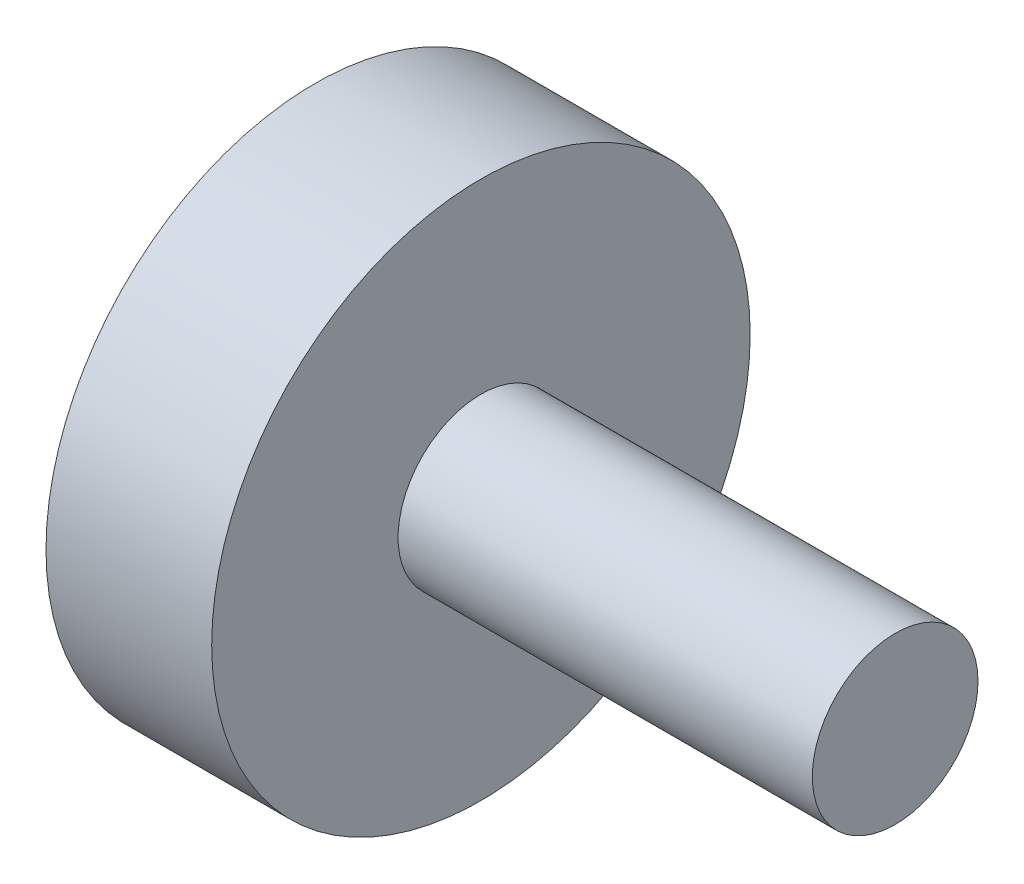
ISO-10303-21;
HEADER;
FILE_DESCRIPTION(('STEP AP214'),'2;1');
FILE_NAME('part.step','',(''),(''),'','','');
FILE_SCHEMA(('AUTOMOTIVE_DESIGN { 1 0 10303 214 1 1 1 1 }'));
ENDSEC;
DATA;
#1=APPLICATION_CONTEXT('core data for automotive mechanical design processes');
#2=APPLICATION_PROTOCOL_DEFINITION('international standard','automotive_design',2000,#1);
#3=PRODUCT_CONTEXT('',#1,'mechanical');
#4=PRODUCT('Part','Part','',(#3));
#5=PRODUCT_RELATED_PRODUCT_CATEGORY('part','',(#4));
#6=PRODUCT_DEFINITION_FORMATION('','',#4);
#7=PRODUCT_DEFINITION_CONTEXT('part definition',#1,'design');
#8=PRODUCT_DEFINITION('design','',#6,#7);
#9=PRODUCT_DEFINITION_SHAPE('','',#8);
#10=(LENGTH_UNIT() NAMED_UNIT(*) SI_UNIT(.MILLI.,.METRE.));
#11=(NAMED_UNIT(*) PLANE_ANGLE_UNIT() SI_UNIT($,.RADIAN.));
#12=(NAMED_UNIT(*) SI_UNIT($,.STERADIAN.) SOLID_ANGLE_UNIT());
#13=UNCERTAINTY_MEASURE_WITH_UNIT(LENGTH_MEASURE(1.E-05),#10,'distance_accuracy_value','');
#14=(GEOMETRIC_REPRESENTATION_CONTEXT(3) GLOBAL_UNCERTAINTY_ASSIGNED_CONTEXT((#13)) GLOBAL_UNIT_ASSIGNED_CONTEXT((#10,
#11,#12)) REPRESENTATION_CONTEXT('',''));
#15=CARTESIAN_POINT('',(0.,0.,0.));
#16=DIRECTION('',(0.,0.,1.));
#17=DIRECTION('',(1.,0.,0.));
#18=AXIS2_PLACEMENT_3D('',#15,#16,#17);
#19=CARTESIAN_POINT('',(24.,7.05,0.));
#20=DIRECTION('',(1.,0.,0.));
#21=DIRECTION('',(0.,0.,-1.));
#22=AXIS2_PLACEMENT_3D('',#19,#20,#21);
#23=PLANE('',#22);
#24=CARTESIAN_POINT('',(24.,7.55,0.));
#25=DIRECTION('',(1.,0.,0.));
#26=DIRECTION('',(0.,0.,-1.));
#27=AXIS2_PLACEMENT_3D('',#24,#25,#26);
#28=CIRCLE('',#27,3.25);
#29=CARTESIAN_POINT('',(24.,7.55,-3.25));
#30=VERTEX_POINT('',#29);
#31=EDGE_CURVE('E10',#30,#30,#28,.T.);
#32=ORIENTED_EDGE('',*,*,#31,.F.);
#33=EDGE_LOOP('',(#32));
#34=FACE_BOUND('',#33,.T.);
#35=CARTESIAN_POINT('',(24.,7.55,0.));
#36=DIRECTION('',(1.,0.,0.));
#37=DIRECTION('',(0.,0.,-1.));
#38=AXIS2_PLACEMENT_3D('',#35,#36,#37);
#39=CIRCLE('',#38,0.5);
#40=CARTESIAN_POINT('',(24.,7.55,-0.5));
#41=VERTEX_POINT('',#40);
#42=EDGE_CURVE('E388',#41,#41,#39,.T.);
#43=ORIENTED_EDGE('',*,*,#42,.T.);
#44=EDGE_LOOP('',(#43));
#45=FACE_BOUND('',#44,.T.);
#46=ADVANCED_FACE('F366',(#34,#45),#23,.F.);
#47=CARTESIAN_POINT('',(26.,7.55,0.));
#48=DIRECTION('',(1.,0.,0.));
#49=DIRECTION('',(0.,0.,-1.));
#50=AXIS2_PLACEMENT_3D('',#47,#48,#49);
#51=CYLINDRICAL_SURFACE('',#50,3.25);
#52=CARTESIAN_POINT('',(26.,7.55,0.));
#53=DIRECTION('',(1.,0.,0.));
#54=DIRECTION('',(0.,0.,-1.));
#55=AXIS2_PLACEMENT_3D('',#52,#53,#54);
#56=CIRCLE('',#55,3.25);
#57=CARTESIAN_POINT('',(26.,7.55,-3.25));
#58=VERTEX_POINT('',#57);
#59=EDGE_CURVE('E372',#58,#58,#56,.T.);
#60=ORIENTED_EDGE('',*,*,#59,.F.);
#61=EDGE_LOOP('',(#60));
#62=FACE_BOUND('',#61,.T.);
#63=ORIENTED_EDGE('',*,*,#31,.T.);
#64=EDGE_LOOP('',(#63));
#65=FACE_BOUND('',#64,.T.);
#66=ADVANCED_FACE('F410',(#62,#65),#51,.T.);
#67=CARTESIAN_POINT('',(26.,4.3,0.));
#68=DIRECTION('',(-1.,0.,0.));
#69=DIRECTION('',(0.,0.,1.));
#70=AXIS2_PLACEMENT_3D('',#67,#68,#69);
#71=PLANE('',#70);
#72=CARTESIAN_POINT('',(26.,7.55,0.));
#73=DIRECTION('',(1.,0.,0.));
#74=DIRECTION('',(0.,0.,-1.));
#75=AXIS2_PLACEMENT_3D('',#72,#73,#74);
#76=CIRCLE('',#75,0.999999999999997);
#77=CARTESIAN_POINT('',(26.,7.55,-0.999999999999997));
#78=VERTEX_POINT('',#77);
#79=EDGE_CURVE('E376',#78,#78,#76,.T.);
#80=ORIENTED_EDGE('',*,*,#79,.F.);
#81=EDGE_LOOP('',(#80));
#82=FACE_BOUND('',#81,.T.);
#83=ORIENTED_EDGE('',*,*,#59,.T.);
#84=EDGE_LOOP('',(#83));
#85=FACE_BOUND('',#84,.T.);
#86=ADVANCED_FACE('F415',(#82,#85),#71,.F.);
#87=CARTESIAN_POINT('',(26.,7.55,0.));
#88=DIRECTION('',(1.,0.,0.));
#89=DIRECTION('',(0.,0.,-1.));
#90=AXIS2_PLACEMENT_3D('',#87,#88,#89);
#91=CYLINDRICAL_SURFACE('',#90,0.999999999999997);
#92=CARTESIAN_POINT('',(31.,7.55,0.));
#93=DIRECTION('',(1.,0.,0.));
#94=DIRECTION('',(0.,0.,-1.));
#95=AXIS2_PLACEMENT_3D('',#92,#93,#94);
#96=CIRCLE('',#95,0.999999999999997);
#97=CARTESIAN_POINT('',(31.,7.55,-0.999999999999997));
#98=VERTEX_POINT('',#97);
#99=EDGE_CURVE('E380',#98,#98,#96,.T.);
#100=ORIENTED_EDGE('',*,*,#99,.F.);
#101=EDGE_LOOP('',(#100));
#102=FACE_BOUND('',#101,.T.);
#103=ORIENTED_EDGE('',*,*,#79,.T.);
#104=EDGE_LOOP('',(#103));
#105=FACE_BOUND('',#104,.T.);
#106=ADVANCED_FACE('F406',(#102,#105),#91,.T.);
#107=CARTESIAN_POINT('',(31.,6.55,0.));
#108=DIRECTION('',(-1.,0.,0.));
#109=DIRECTION('',(0.,0.,1.));
#110=AXIS2_PLACEMENT_3D('',#107,#108,#109);
#111=PLANE('',#110);
#112=ORIENTED_EDGE('',*,*,#99,.T.);
#113=EDGE_LOOP('',(#112));
#114=FACE_BOUND('',#113,.T.);
#115=ADVANCED_FACE('F401',(#114),#111,.F.);
#116=CARTESIAN_POINT('',(23.,7.55,0.));
#117=DIRECTION('',(1.,0.,0.));
#118=DIRECTION('',(0.,0.,-1.));
#119=AXIS2_PLACEMENT_3D('',#116,#117,#118);
#120=PLANE('',#119);
#121=CARTESIAN_POINT('',(23.,7.55,0.));
#122=DIRECTION('',(1.,0.,0.));
#123=DIRECTION('',(0.,0.,-1.));
#124=AXIS2_PLACEMENT_3D('',#121,#122,#123);
#125=CIRCLE('',#124,0.5);
#126=CARTESIAN_POINT('',(23.,7.55,-0.5));
#127=VERTEX_POINT('',#126);
#128=EDGE_CURVE('E385',#127,#127,#125,.T.);
#129=ORIENTED_EDGE('',*,*,#128,.F.);
#130=EDGE_LOOP('',(#129));
#131=FACE_BOUND('',#130,.T.);
#132=ADVANCED_FACE('F396',(#131),#120,.F.);
#133=CARTESIAN_POINT('',(26.,7.55,0.));
#134=DIRECTION('',(1.,0.,0.));
#135=DIRECTION('',(0.,0.,-1.));
#136=AXIS2_PLACEMENT_3D('',#133,#134,#135);
#137=CYLINDRICAL_SURFACE('',#136,0.5);
#138=ORIENTED_EDGE('',*,*,#42,.F.);
#139=EDGE_LOOP('',(#138));
#140=FACE_BOUND('',#139,.T.);
#141=ORIENTED_EDGE('',*,*,#128,.T.);
#142=EDGE_LOOP('',(#141));
#143=FACE_BOUND('',#142,.T.);
#144=ADVANCED_FACE('F393',(#140,#143),#137,.T.);
#145=CLOSED_SHELL('',(#46,#66,#86,#106,#115,#132,#144));
#146=MANIFOLD_SOLID_BREP('B2',#145);
#147=ADVANCED_BREP_SHAPE_REPRESENTATION('',(#18,#146),#14);
#148=SHAPE_DEFINITION_REPRESENTATION(#9,#147);
ENDSEC;
END-ISO-10303-21;
